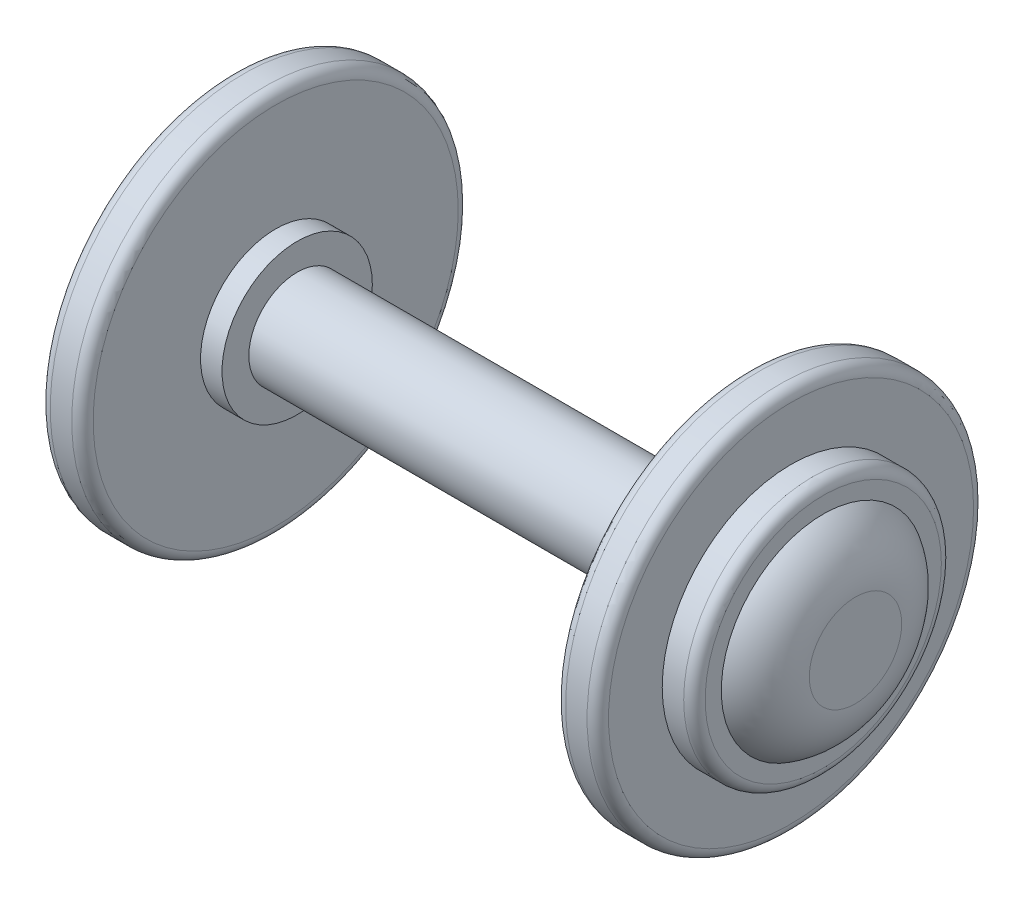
ISO-10303-21;
HEADER;
FILE_DESCRIPTION(('STEP AP214'),'2;1');
FILE_NAME('part.step','',(''),(''),'','','');
FILE_SCHEMA(('AUTOMOTIVE_DESIGN { 1 0 10303 214 1 1 1 1 }'));
ENDSEC;
DATA;
#1=APPLICATION_CONTEXT('core data for automotive mechanical design processes');
#2=APPLICATION_PROTOCOL_DEFINITION('international standard','automotive_design',2000,#1);
#3=PRODUCT_CONTEXT('',#1,'mechanical');
#4=PRODUCT('Part','Part','',(#3));
#5=PRODUCT_RELATED_PRODUCT_CATEGORY('part','',(#4));
#6=PRODUCT_DEFINITION_FORMATION('','',#4);
#7=PRODUCT_DEFINITION_CONTEXT('part definition',#1,'design');
#8=PRODUCT_DEFINITION('design','',#6,#7);
#9=PRODUCT_DEFINITION_SHAPE('','',#8);
#10=(LENGTH_UNIT() NAMED_UNIT(*) SI_UNIT(.MILLI.,.METRE.));
#11=(NAMED_UNIT(*) PLANE_ANGLE_UNIT() SI_UNIT($,.RADIAN.));
#12=(NAMED_UNIT(*) SI_UNIT($,.STERADIAN.) SOLID_ANGLE_UNIT());
#13=UNCERTAINTY_MEASURE_WITH_UNIT(LENGTH_MEASURE(1.E-05),#10,'distance_accuracy_value','');
#14=(GEOMETRIC_REPRESENTATION_CONTEXT(3) GLOBAL_UNCERTAINTY_ASSIGNED_CONTEXT((#13)) GLOBAL_UNIT_ASSIGNED_CONTEXT((#10,
#11,#12)) REPRESENTATION_CONTEXT('',''));
#15=CARTESIAN_POINT('',(0.,0.,0.));
#16=DIRECTION('',(0.,0.,1.));
#17=DIRECTION('',(1.,0.,0.));
#18=AXIS2_PLACEMENT_3D('',#15,#16,#17);
#19=CARTESIAN_POINT('',(11.,6.78141714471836,-5.25000000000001));
#20=DIRECTION('',(1.,0.,0.));
#21=DIRECTION('',(0.,0.,-1.));
#22=AXIS2_PLACEMENT_3D('',#19,#20,#21);
#23=PLANE('',#22);
#24=CARTESIAN_POINT('',(11.,6.78141714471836,-5.25000000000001));
#25=DIRECTION('',(1.,0.,0.));
#26=DIRECTION('',(0.,0.,-1.));
#27=AXIS2_PLACEMENT_3D('',#24,#25,#26);
#28=CIRCLE('',#27,2.25);
#29=CARTESIAN_POINT('',(11.,6.78141714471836,-7.50000000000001));
#30=VERTEX_POINT('',#29);
#31=EDGE_CURVE('E60',#30,#30,#28,.T.);
#32=ORIENTED_EDGE('',*,*,#31,.F.);
#33=EDGE_LOOP('',(#32));
#34=FACE_BOUND('',#33,.T.);
#35=CARTESIAN_POINT('',(11.,6.78141714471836,-5.25000000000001));
#36=DIRECTION('',(1.,0.,0.));
#37=DIRECTION('',(0.,0.,-1.));
#38=AXIS2_PLACEMENT_3D('',#35,#36,#37);
#39=CIRCLE('',#38,3.5);
#40=CARTESIAN_POINT('',(11.,6.78141714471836,-8.75000000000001));
#41=VERTEX_POINT('',#40);
#42=EDGE_CURVE('E11',#41,#41,#39,.T.);
#43=ORIENTED_EDGE('',*,*,#42,.T.);
#44=EDGE_LOOP('',(#43));
#45=FACE_BOUND('',#44,.T.);
#46=ADVANCED_FACE('F47',(#34,#45),#23,.T.);
#47=CARTESIAN_POINT('',(10.,6.78141714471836,-5.25000000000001));
#48=DIRECTION('',(1.,0.,0.));
#49=DIRECTION('',(0.,0.,-1.));
#50=AXIS2_PLACEMENT_3D('',#47,#48,#49);
#51=PLANE('',#50);
#52=CARTESIAN_POINT('',(10.,6.78141714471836,-5.25000000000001));
#53=DIRECTION('',(1.,0.,0.));
#54=DIRECTION('',(0.,0.,-1.));
#55=AXIS2_PLACEMENT_3D('',#52,#53,#54);
#56=CIRCLE('',#55,2.25);
#57=CARTESIAN_POINT('',(10.,6.78141714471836,-7.50000000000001));
#58=VERTEX_POINT('',#57);
#59=EDGE_CURVE('E51',#58,#58,#56,.T.);
#60=ORIENTED_EDGE('',*,*,#59,.T.);
#61=EDGE_LOOP('',(#60));
#62=FACE_BOUND('',#61,.T.);
#63=CARTESIAN_POINT('',(10.,6.78141714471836,-5.25000000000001));
#64=DIRECTION('',(1.,0.,0.));
#65=DIRECTION('',(0.,0.,-1.));
#66=AXIS2_PLACEMENT_3D('',#63,#64,#65);
#67=CIRCLE('',#66,3.5);
#68=CARTESIAN_POINT('',(10.,6.78141714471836,-8.75000000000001));
#69=VERTEX_POINT('',#68);
#70=EDGE_CURVE('E55',#69,#69,#67,.T.);
#71=ORIENTED_EDGE('',*,*,#70,.F.);
#72=EDGE_LOOP('',(#71));
#73=FACE_BOUND('',#72,.T.);
#74=ADVANCED_FACE('F68',(#62,#73),#51,.F.);
#75=CARTESIAN_POINT('',(11.,6.78141714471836,-5.25000000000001));
#76=DIRECTION('',(-1.,0.,0.));
#77=DIRECTION('',(0.,0.,1.));
#78=AXIS2_PLACEMENT_3D('',#75,#76,#77);
#79=CYLINDRICAL_SURFACE('',#78,3.5);
#80=ORIENTED_EDGE('',*,*,#42,.F.);
#81=EDGE_LOOP('',(#80));
#82=FACE_BOUND('',#81,.T.);
#83=ORIENTED_EDGE('',*,*,#70,.T.);
#84=EDGE_LOOP('',(#83));
#85=FACE_BOUND('',#84,.T.);
#86=ADVANCED_FACE('F49',(#82,#85),#79,.T.);
#87=CARTESIAN_POINT('',(-15.,6.78141714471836,-5.25000000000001));
#88=DIRECTION('',(1.,0.,0.));
#89=DIRECTION('',(0.,0.,-1.));
#90=AXIS2_PLACEMENT_3D('',#87,#88,#89);
#91=CYLINDRICAL_SURFACE('',#90,2.25);
#92=ORIENTED_EDGE('',*,*,#31,.T.);
#93=EDGE_LOOP('',(#92));
#94=FACE_BOUND('',#93,.T.);
#95=ORIENTED_EDGE('',*,*,#59,.F.);
#96=EDGE_LOOP('',(#95));
#97=FACE_BOUND('',#96,.T.);
#98=ADVANCED_FACE('F71',(#94,#97),#91,.F.);
#99=CLOSED_SHELL('',(#46,#74,#86,#98));
#100=MANIFOLD_SOLID_BREP('B2',#99);
#101=CARTESIAN_POINT('',(13.,6.78141714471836,-5.25000000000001));
#102=DIRECTION('',(1.,0.,0.));
#103=DIRECTION('',(0.,0.,-1.));
#104=AXIS2_PLACEMENT_3D('',#101,#102,#103);
#105=PLANE('',#104);
#106=CARTESIAN_POINT('',(13.,6.78141714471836,-5.25000000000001));
#107=DIRECTION('',(1.,0.,0.));
#108=DIRECTION('',(0.,0.,-1.));
#109=AXIS2_PLACEMENT_3D('',#106,#107,#108);
#110=CIRCLE('',#109,8.5);
#111=CARTESIAN_POINT('',(13.,6.78141714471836,-13.75));
#112=VERTEX_POINT('',#111);
#113=EDGE_CURVE('E46',#112,#112,#110,.T.);
#114=ORIENTED_EDGE('',*,*,#113,.T.);
#115=EDGE_LOOP('',(#114));
#116=FACE_BOUND('',#115,.T.);
#117=CARTESIAN_POINT('',(13.,6.78141714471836,-5.25000000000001));
#118=DIRECTION('',(1.,0.,0.));
#119=DIRECTION('',(0.,0.,-1.));
#120=AXIS2_PLACEMENT_3D('',#117,#118,#119);
#121=CIRCLE('',#120,6.);
#122=CARTESIAN_POINT('',(13.,6.78141714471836,-11.25));
#123=VERTEX_POINT('',#122);
#124=EDGE_CURVE('E148',#123,#123,#121,.T.);
#125=ORIENTED_EDGE('',*,*,#124,.F.);
#126=EDGE_LOOP('',(#125));
#127=FACE_BOUND('',#126,.T.);
#128=ADVANCED_FACE('F119',(#116,#127),#105,.T.);
#129=CARTESIAN_POINT('',(11.,6.78141714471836,-5.25000000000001));
#130=DIRECTION('',(1.,0.,0.));
#131=DIRECTION('',(0.,0.,-1.));
#132=AXIS2_PLACEMENT_3D('',#129,#130,#131);
#133=PLANE('',#132);
#134=CARTESIAN_POINT('',(11.,6.78141714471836,-5.25000000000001));
#135=DIRECTION('',(1.,0.,0.));
#136=DIRECTION('',(0.,0.,-1.));
#137=AXIS2_PLACEMENT_3D('',#134,#135,#136);
#138=CIRCLE('',#137,8.5);
#139=CARTESIAN_POINT('',(11.,6.78141714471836,-13.75));
#140=VERTEX_POINT('',#139);
#141=EDGE_CURVE('E126',#140,#140,#138,.F.);
#142=ORIENTED_EDGE('',*,*,#141,.T.);
#143=EDGE_LOOP('',(#142));
#144=FACE_BOUND('',#143,.T.);
#145=CARTESIAN_POINT('',(11.,6.78141714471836,-5.25000000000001));
#146=DIRECTION('',(1.,0.,0.));
#147=DIRECTION('',(0.,0.,-1.));
#148=AXIS2_PLACEMENT_3D('',#145,#146,#147);
#149=CIRCLE('',#148,2.5);
#150=CARTESIAN_POINT('',(11.,6.78141714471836,-7.75000000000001));
#151=VERTEX_POINT('',#150);
#152=EDGE_CURVE('E145',#151,#151,#149,.T.);
#153=ORIENTED_EDGE('',*,*,#152,.T.);
#154=EDGE_LOOP('',(#153));
#155=FACE_BOUND('',#154,.T.);
#156=ADVANCED_FACE('F172',(#144,#155),#133,.F.);
#157=CARTESIAN_POINT('',(13.,6.78141714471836,-5.25000000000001));
#158=DIRECTION('',(-1.,0.,0.));
#159=DIRECTION('',(0.,0.,1.));
#160=AXIS2_PLACEMENT_3D('',#157,#158,#159);
#161=CYLINDRICAL_SURFACE('',#160,9.);
#162=CARTESIAN_POINT('',(11.5,6.78141714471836,-5.25000000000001));
#163=DIRECTION('',(1.,0.,0.));
#164=DIRECTION('',(0.,0.,-1.));
#165=AXIS2_PLACEMENT_3D('',#162,#163,#164);
#166=CIRCLE('',#165,9.);
#167=CARTESIAN_POINT('',(11.5,6.78141714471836,-14.25));
#168=VERTEX_POINT('',#167);
#169=EDGE_CURVE('E130',#168,#168,#166,.T.);
#170=ORIENTED_EDGE('',*,*,#169,.T.);
#171=EDGE_LOOP('',(#170));
#172=FACE_BOUND('',#171,.T.);
#173=CARTESIAN_POINT('',(12.5,6.78141714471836,-5.25000000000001));
#174=DIRECTION('',(1.,0.,0.));
#175=DIRECTION('',(0.,0.,-1.));
#176=AXIS2_PLACEMENT_3D('',#173,#174,#175);
#177=CIRCLE('',#176,9.);
#178=CARTESIAN_POINT('',(12.5,6.78141714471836,-14.25));
#179=VERTEX_POINT('',#178);
#180=EDGE_CURVE('E134',#179,#179,#177,.F.);
#181=ORIENTED_EDGE('',*,*,#180,.T.);
#182=EDGE_LOOP('',(#181));
#183=FACE_BOUND('',#182,.T.);
#184=ADVANCED_FACE('F168',(#172,#183),#161,.T.);
#185=CARTESIAN_POINT('',(13.,6.78141714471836,-5.25000000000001));
#186=DIRECTION('',(-1.,0.,0.));
#187=DIRECTION('',(0.,0.,1.));
#188=AXIS2_PLACEMENT_3D('',#185,#186,#187);
#189=CYLINDRICAL_SURFACE('',#188,2.5);
#190=ORIENTED_EDGE('',*,*,#152,.F.);
#191=EDGE_LOOP('',(#190));
#192=FACE_BOUND('',#191,.T.);
#193=CARTESIAN_POINT('',(14.5,6.78141714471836,-5.25000000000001));
#194=DIRECTION('',(1.,0.,0.));
#195=DIRECTION('',(0.,0.,-1.));
#196=AXIS2_PLACEMENT_3D('',#193,#194,#195);
#197=CIRCLE('',#196,2.5);
#198=CARTESIAN_POINT('',(14.5,6.78141714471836,-7.75000000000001));
#199=VERTEX_POINT('',#198);
#200=EDGE_CURVE('E151',#199,#199,#197,.T.);
#201=ORIENTED_EDGE('',*,*,#200,.T.);
#202=EDGE_LOOP('',(#201));
#203=FACE_BOUND('',#202,.T.);
#204=ADVANCED_FACE('F155',(#192,#203),#189,.F.);
#205=CARTESIAN_POINT('',(14.5,6.78141714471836,-5.25000000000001));
#206=DIRECTION('',(1.,0.,0.));
#207=DIRECTION('',(0.,0.,-1.));
#208=AXIS2_PLACEMENT_3D('',#205,#206,#207);
#209=PLANE('',#208);
#210=CARTESIAN_POINT('',(14.5,6.78141714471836,-5.25000000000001));
#211=DIRECTION('',(1.,0.,0.));
#212=DIRECTION('',(0.,0.,-1.));
#213=AXIS2_PLACEMENT_3D('',#210,#211,#212);
#214=CIRCLE('',#213,5.5);
#215=CARTESIAN_POINT('',(14.5,6.78141714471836,-10.75));
#216=VERTEX_POINT('',#215);
#217=EDGE_CURVE('E142',#216,#216,#214,.T.);
#218=ORIENTED_EDGE('',*,*,#217,.T.);
#219=EDGE_LOOP('',(#218));
#220=FACE_BOUND('',#219,.T.);
#221=ORIENTED_EDGE('',*,*,#200,.F.);
#222=EDGE_LOOP('',(#221));
#223=FACE_BOUND('',#222,.T.);
#224=ADVANCED_FACE('F157',(#220,#223),#209,.T.);
#225=CARTESIAN_POINT('',(14.5,6.78141714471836,-5.25000000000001));
#226=DIRECTION('',(-1.,0.,0.));
#227=DIRECTION('',(0.,0.,1.));
#228=AXIS2_PLACEMENT_3D('',#225,#226,#227);
#229=CYLINDRICAL_SURFACE('',#228,6.);
#230=CARTESIAN_POINT('',(14.,6.78141714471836,-5.25000000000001));
#231=DIRECTION('',(1.,0.,0.));
#232=DIRECTION('',(0.,0.,-1.));
#233=AXIS2_PLACEMENT_3D('',#230,#231,#232);
#234=CIRCLE('',#233,6.);
#235=CARTESIAN_POINT('',(14.,6.78141714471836,-11.25));
#236=VERTEX_POINT('',#235);
#237=EDGE_CURVE('E139',#236,#236,#234,.F.);
#238=ORIENTED_EDGE('',*,*,#237,.T.);
#239=EDGE_LOOP('',(#238));
#240=FACE_BOUND('',#239,.T.);
#241=ORIENTED_EDGE('',*,*,#124,.T.);
#242=EDGE_LOOP('',(#241));
#243=FACE_BOUND('',#242,.T.);
#244=ADVANCED_FACE('F159',(#240,#243),#229,.T.);
#245=CARTESIAN_POINT('',(14.,6.78141714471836,-5.25000000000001));
#246=DIRECTION('',(1.,0.,0.));
#247=DIRECTION('',(0.,0.,-1.));
#248=AXIS2_PLACEMENT_3D('',#245,#246,#247);
#249=TOROIDAL_SURFACE('',#248,5.5,0.5);
#250=ORIENTED_EDGE('',*,*,#237,.F.);
#251=EDGE_LOOP('',(#250));
#252=FACE_BOUND('',#251,.T.);
#253=ORIENTED_EDGE('',*,*,#217,.F.);
#254=EDGE_LOOP('',(#253));
#255=FACE_BOUND('',#254,.T.);
#256=ADVANCED_FACE('F164',(#252,#255),#249,.T.);
#257=CARTESIAN_POINT('',(11.5,6.78141714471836,-5.25000000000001));
#258=DIRECTION('',(1.,0.,0.));
#259=DIRECTION('',(0.,0.,-1.));
#260=AXIS2_PLACEMENT_3D('',#257,#258,#259);
#261=TOROIDAL_SURFACE('',#260,8.5,0.5);
#262=ORIENTED_EDGE('',*,*,#141,.F.);
#263=EDGE_LOOP('',(#262));
#264=FACE_BOUND('',#263,.T.);
#265=ORIENTED_EDGE('',*,*,#169,.F.);
#266=EDGE_LOOP('',(#265));
#267=FACE_BOUND('',#266,.T.);
#268=ADVANCED_FACE('F184',(#264,#267),#261,.T.);
#269=CARTESIAN_POINT('',(12.5,6.78141714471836,-5.25000000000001));
#270=DIRECTION('',(1.,0.,0.));
#271=DIRECTION('',(0.,0.,-1.));
#272=AXIS2_PLACEMENT_3D('',#269,#270,#271);
#273=TOROIDAL_SURFACE('',#272,8.5,0.5);
#274=ORIENTED_EDGE('',*,*,#180,.F.);
#275=EDGE_LOOP('',(#274));
#276=FACE_BOUND('',#275,.T.);
#277=ORIENTED_EDGE('',*,*,#113,.F.);
#278=EDGE_LOOP('',(#277));
#279=FACE_BOUND('',#278,.T.);
#280=ADVANCED_FACE('F121',(#276,#279),#273,.T.);
#281=CLOSED_SHELL('',(#128,#156,#184,#204,#224,#244,#256,#268,#280));
#282=MANIFOLD_SOLID_BREP('B6',#281);
#283=CARTESIAN_POINT('',(-11.,6.78141714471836,-5.25000000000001));
#284=DIRECTION('',(-1.,0.,0.));
#285=DIRECTION('',(0.,0.,-1.));
#286=AXIS2_PLACEMENT_3D('',#283,#284,#285);
#287=PLANE('',#286);
#288=CARTESIAN_POINT('',(-11.,6.78141714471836,-5.25000000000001));
#289=DIRECTION('',(-1.,0.,0.));
#290=DIRECTION('',(0.,0.,1.));
#291=AXIS2_PLACEMENT_3D('',#288,#289,#290);
#292=CIRCLE('',#291,2.25);
#293=CARTESIAN_POINT('',(-11.,6.78141714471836,-3.00000000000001));
#294=VERTEX_POINT('',#293);
#295=EDGE_CURVE('E280',#294,#294,#292,.T.);
#296=ORIENTED_EDGE('',*,*,#295,.F.);
#297=EDGE_LOOP('',(#296));
#298=FACE_BOUND('',#297,.T.);
#299=CARTESIAN_POINT('',(-11.,6.78141714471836,-5.25000000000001));
#300=DIRECTION('',(1.,0.,0.));
#301=DIRECTION('',(0.,0.,-1.));
#302=AXIS2_PLACEMENT_3D('',#299,#300,#301);
#303=CIRCLE('',#302,3.5);
#304=CARTESIAN_POINT('',(-11.,6.78141714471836,-8.75000000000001));
#305=VERTEX_POINT('',#304);
#306=EDGE_CURVE('E118',#305,#305,#303,.T.);
#307=ORIENTED_EDGE('',*,*,#306,.F.);
#308=EDGE_LOOP('',(#307));
#309=FACE_BOUND('',#308,.T.);
#310=ADVANCED_FACE('F267',(#298,#309),#287,.T.);
#311=CARTESIAN_POINT('',(-10.,6.78141714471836,-5.25000000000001));
#312=DIRECTION('',(-1.,0.,0.));
#313=DIRECTION('',(0.,0.,-1.));
#314=AXIS2_PLACEMENT_3D('',#311,#312,#313);
#315=PLANE('',#314);
#316=CARTESIAN_POINT('',(-10.,6.78141714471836,-5.25000000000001));
#317=DIRECTION('',(-1.,0.,0.));
#318=DIRECTION('',(0.,0.,1.));
#319=AXIS2_PLACEMENT_3D('',#316,#317,#318);
#320=CIRCLE('',#319,2.25);
#321=CARTESIAN_POINT('',(-10.,6.78141714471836,-3.00000000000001));
#322=VERTEX_POINT('',#321);
#323=EDGE_CURVE('E271',#322,#322,#320,.T.);
#324=ORIENTED_EDGE('',*,*,#323,.T.);
#325=EDGE_LOOP('',(#324));
#326=FACE_BOUND('',#325,.T.);
#327=CARTESIAN_POINT('',(-10.,6.78141714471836,-5.25000000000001));
#328=DIRECTION('',(1.,0.,0.));
#329=DIRECTION('',(0.,0.,-1.));
#330=AXIS2_PLACEMENT_3D('',#327,#328,#329);
#331=CIRCLE('',#330,3.5);
#332=CARTESIAN_POINT('',(-10.,6.78141714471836,-8.75000000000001));
#333=VERTEX_POINT('',#332);
#334=EDGE_CURVE('E275',#333,#333,#331,.T.);
#335=ORIENTED_EDGE('',*,*,#334,.T.);
#336=EDGE_LOOP('',(#335));
#337=FACE_BOUND('',#336,.T.);
#338=ADVANCED_FACE('F288',(#326,#337),#315,.F.);
#339=CARTESIAN_POINT('',(-11.,6.78141714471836,-5.25000000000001));
#340=DIRECTION('',(1.,0.,0.));
#341=DIRECTION('',(0.,0.,1.));
#342=AXIS2_PLACEMENT_3D('',#339,#340,#341);
#343=CYLINDRICAL_SURFACE('',#342,3.5);
#344=ORIENTED_EDGE('',*,*,#306,.T.);
#345=EDGE_LOOP('',(#344));
#346=FACE_BOUND('',#345,.T.);
#347=ORIENTED_EDGE('',*,*,#334,.F.);
#348=EDGE_LOOP('',(#347));
#349=FACE_BOUND('',#348,.T.);
#350=ADVANCED_FACE('F269',(#346,#349),#343,.T.);
#351=CARTESIAN_POINT('',(-15.,6.78141714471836,-5.25000000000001));
#352=DIRECTION('',(1.,0.,0.));
#353=DIRECTION('',(0.,0.,-1.));
#354=AXIS2_PLACEMENT_3D('',#351,#352,#353);
#355=CYLINDRICAL_SURFACE('',#354,2.25);
#356=ORIENTED_EDGE('',*,*,#295,.T.);
#357=EDGE_LOOP('',(#356));
#358=FACE_BOUND('',#357,.T.);
#359=ORIENTED_EDGE('',*,*,#323,.F.);
#360=EDGE_LOOP('',(#359));
#361=FACE_BOUND('',#360,.T.);
#362=ADVANCED_FACE('F291',(#358,#361),#355,.F.);
#363=CLOSED_SHELL('',(#310,#338,#350,#362));
#364=MANIFOLD_SOLID_BREP('B41',#363);
#365=CARTESIAN_POINT('',(-13.,6.78141714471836,-5.25000000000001));
#366=DIRECTION('',(-1.,0.,0.));
#367=DIRECTION('',(0.,0.,-1.));
#368=AXIS2_PLACEMENT_3D('',#365,#366,#367);
#369=PLANE('',#368);
#370=CARTESIAN_POINT('',(-13.,6.78141714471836,-5.25000000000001));
#371=DIRECTION('',(1.,0.,0.));
#372=DIRECTION('',(0.,0.,-1.));
#373=AXIS2_PLACEMENT_3D('',#370,#371,#372);
#374=CIRCLE('',#373,8.5);
#375=CARTESIAN_POINT('',(-13.,6.78141714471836,-13.75));
#376=VERTEX_POINT('',#375);
#377=EDGE_CURVE('E266',#376,#376,#374,.T.);
#378=ORIENTED_EDGE('',*,*,#377,.F.);
#379=EDGE_LOOP('',(#378));
#380=FACE_BOUND('',#379,.T.);
#381=CARTESIAN_POINT('',(-13.,6.78141714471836,-5.25000000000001));
#382=DIRECTION('',(1.,0.,0.));
#383=DIRECTION('',(0.,0.,-1.));
#384=AXIS2_PLACEMENT_3D('',#381,#382,#383);
#385=CIRCLE('',#384,6.);
#386=CARTESIAN_POINT('',(-13.,6.78141714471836,-11.25));
#387=VERTEX_POINT('',#386);
#388=EDGE_CURVE('E367',#387,#387,#385,.T.);
#389=ORIENTED_EDGE('',*,*,#388,.T.);
#390=EDGE_LOOP('',(#389));
#391=FACE_BOUND('',#390,.T.);
#392=ADVANCED_FACE('F338',(#380,#391),#369,.T.);
#393=CARTESIAN_POINT('',(-11.,6.78141714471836,-5.25000000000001));
#394=DIRECTION('',(-1.,0.,0.));
#395=DIRECTION('',(0.,0.,-1.));
#396=AXIS2_PLACEMENT_3D('',#393,#394,#395);
#397=PLANE('',#396);
#398=CARTESIAN_POINT('',(-11.,6.78141714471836,-5.25000000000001));
#399=DIRECTION('',(1.,0.,0.));
#400=DIRECTION('',(0.,0.,-1.));
#401=AXIS2_PLACEMENT_3D('',#398,#399,#400);
#402=CIRCLE('',#401,8.5);
#403=CARTESIAN_POINT('',(-11.,6.78141714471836,-13.75));
#404=VERTEX_POINT('',#403);
#405=EDGE_CURVE('E345',#404,#404,#402,.F.);
#406=ORIENTED_EDGE('',*,*,#405,.F.);
#407=EDGE_LOOP('',(#406));
#408=FACE_BOUND('',#407,.T.);
#409=CARTESIAN_POINT('',(-11.,6.78141714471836,-5.25000000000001));
#410=DIRECTION('',(1.,0.,0.));
#411=DIRECTION('',(0.,0.,-1.));
#412=AXIS2_PLACEMENT_3D('',#409,#410,#411);
#413=CIRCLE('',#412,2.5);
#414=CARTESIAN_POINT('',(-11.,6.78141714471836,-7.75000000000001));
#415=VERTEX_POINT('',#414);
#416=EDGE_CURVE('E364',#415,#415,#413,.T.);
#417=ORIENTED_EDGE('',*,*,#416,.F.);
#418=EDGE_LOOP('',(#417));
#419=FACE_BOUND('',#418,.T.);
#420=ADVANCED_FACE('F388',(#408,#419),#397,.F.);
#421=CARTESIAN_POINT('',(-13.,6.78141714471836,-5.25000000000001));
#422=DIRECTION('',(1.,0.,0.));
#423=DIRECTION('',(0.,0.,1.));
#424=AXIS2_PLACEMENT_3D('',#421,#422,#423);
#425=CYLINDRICAL_SURFACE('',#424,9.);
#426=CARTESIAN_POINT('',(-11.5,6.78141714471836,-5.25000000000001));
#427=DIRECTION('',(1.,0.,0.));
#428=DIRECTION('',(0.,0.,-1.));
#429=AXIS2_PLACEMENT_3D('',#426,#427,#428);
#430=CIRCLE('',#429,9.);
#431=CARTESIAN_POINT('',(-11.5,6.78141714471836,-14.25));
#432=VERTEX_POINT('',#431);
#433=EDGE_CURVE('E349',#432,#432,#430,.T.);
#434=ORIENTED_EDGE('',*,*,#433,.F.);
#435=EDGE_LOOP('',(#434));
#436=FACE_BOUND('',#435,.T.);
#437=CARTESIAN_POINT('',(-12.5,6.78141714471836,-5.25000000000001));
#438=DIRECTION('',(1.,0.,0.));
#439=DIRECTION('',(0.,0.,-1.));
#440=AXIS2_PLACEMENT_3D('',#437,#438,#439);
#441=CIRCLE('',#440,9.);
#442=CARTESIAN_POINT('',(-12.5,6.78141714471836,-14.25));
#443=VERTEX_POINT('',#442);
#444=EDGE_CURVE('E353',#443,#443,#441,.F.);
#445=ORIENTED_EDGE('',*,*,#444,.F.);
#446=EDGE_LOOP('',(#445));
#447=FACE_BOUND('',#446,.T.);
#448=ADVANCED_FACE('F378',(#436,#447),#425,.T.);
#449=CARTESIAN_POINT('',(-13.,6.78141714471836,-5.25000000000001));
#450=DIRECTION('',(1.,0.,0.));
#451=DIRECTION('',(0.,0.,1.));
#452=AXIS2_PLACEMENT_3D('',#449,#450,#451);
#453=CYLINDRICAL_SURFACE('',#452,2.5);
#454=ORIENTED_EDGE('',*,*,#416,.T.);
#455=EDGE_LOOP('',(#454));
#456=FACE_BOUND('',#455,.T.);
#457=CARTESIAN_POINT('',(-14.5,6.78141714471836,-5.25000000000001));
#458=DIRECTION('',(1.,0.,0.));
#459=DIRECTION('',(0.,0.,-1.));
#460=AXIS2_PLACEMENT_3D('',#457,#458,#459);
#461=CIRCLE('',#460,2.5);
#462=CARTESIAN_POINT('',(-14.5,6.78141714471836,-7.75000000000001));
#463=VERTEX_POINT('',#462);
#464=EDGE_CURVE('E370',#463,#463,#461,.T.);
#465=ORIENTED_EDGE('',*,*,#464,.F.);
#466=EDGE_LOOP('',(#465));
#467=FACE_BOUND('',#466,.T.);
#468=ADVANCED_FACE('F376',(#456,#467),#453,.F.);
#469=CARTESIAN_POINT('',(-14.5,6.78141714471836,-5.25000000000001));
#470=DIRECTION('',(-1.,0.,0.));
#471=DIRECTION('',(0.,0.,-1.));
#472=AXIS2_PLACEMENT_3D('',#469,#470,#471);
#473=PLANE('',#472);
#474=CARTESIAN_POINT('',(-14.5,6.78141714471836,-5.25000000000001));
#475=DIRECTION('',(1.,0.,0.));
#476=DIRECTION('',(0.,0.,-1.));
#477=AXIS2_PLACEMENT_3D('',#474,#475,#476);
#478=CIRCLE('',#477,5.5);
#479=CARTESIAN_POINT('',(-14.5,6.78141714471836,-10.75));
#480=VERTEX_POINT('',#479);
#481=EDGE_CURVE('E361',#480,#480,#478,.T.);
#482=ORIENTED_EDGE('',*,*,#481,.F.);
#483=EDGE_LOOP('',(#482));
#484=FACE_BOUND('',#483,.T.);
#485=ORIENTED_EDGE('',*,*,#464,.T.);
#486=EDGE_LOOP('',(#485));
#487=FACE_BOUND('',#486,.T.);
#488=ADVANCED_FACE('F374',(#484,#487),#473,.T.);
#489=CARTESIAN_POINT('',(-14.5,6.78141714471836,-5.25000000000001));
#490=DIRECTION('',(1.,0.,0.));
#491=DIRECTION('',(0.,0.,1.));
#492=AXIS2_PLACEMENT_3D('',#489,#490,#491);
#493=CYLINDRICAL_SURFACE('',#492,6.);
#494=CARTESIAN_POINT('',(-14.,6.78141714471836,-5.25000000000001));
#495=DIRECTION('',(1.,0.,0.));
#496=DIRECTION('',(0.,0.,-1.));
#497=AXIS2_PLACEMENT_3D('',#494,#495,#496);
#498=CIRCLE('',#497,6.);
#499=CARTESIAN_POINT('',(-14.,6.78141714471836,-11.25));
#500=VERTEX_POINT('',#499);
#501=EDGE_CURVE('E358',#500,#500,#498,.F.);
#502=ORIENTED_EDGE('',*,*,#501,.F.);
#503=EDGE_LOOP('',(#502));
#504=FACE_BOUND('',#503,.T.);
#505=ORIENTED_EDGE('',*,*,#388,.F.);
#506=EDGE_LOOP('',(#505));
#507=FACE_BOUND('',#506,.T.);
#508=ADVANCED_FACE('F385',(#504,#507),#493,.T.);
#509=CARTESIAN_POINT('',(-14.,6.78141714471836,-5.25000000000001));
#510=DIRECTION('',(-1.,0.,0.));
#511=DIRECTION('',(0.,0.,-1.));
#512=AXIS2_PLACEMENT_3D('',#509,#510,#511);
#513=TOROIDAL_SURFACE('',#512,5.5,0.5);
#514=ORIENTED_EDGE('',*,*,#501,.T.);
#515=EDGE_LOOP('',(#514));
#516=FACE_BOUND('',#515,.T.);
#517=ORIENTED_EDGE('',*,*,#481,.T.);
#518=EDGE_LOOP('',(#517));
#519=FACE_BOUND('',#518,.T.);
#520=ADVANCED_FACE('F402',(#516,#519),#513,.T.);
#521=CARTESIAN_POINT('',(-11.5,6.78141714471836,-5.25000000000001));
#522=DIRECTION('',(-1.,0.,0.));
#523=DIRECTION('',(0.,0.,-1.));
#524=AXIS2_PLACEMENT_3D('',#521,#522,#523);
#525=TOROIDAL_SURFACE('',#524,8.5,0.5);
#526=ORIENTED_EDGE('',*,*,#405,.T.);
#527=EDGE_LOOP('',(#526));
#528=FACE_BOUND('',#527,.T.);
#529=ORIENTED_EDGE('',*,*,#433,.T.);
#530=EDGE_LOOP('',(#529));
#531=FACE_BOUND('',#530,.T.);
#532=ADVANCED_FACE('F404',(#528,#531),#525,.T.);
#533=CARTESIAN_POINT('',(-12.5,6.78141714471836,-5.25000000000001));
#534=DIRECTION('',(-1.,0.,0.));
#535=DIRECTION('',(0.,0.,-1.));
#536=AXIS2_PLACEMENT_3D('',#533,#534,#535);
#537=TOROIDAL_SURFACE('',#536,8.5,0.5);
#538=ORIENTED_EDGE('',*,*,#444,.T.);
#539=EDGE_LOOP('',(#538));
#540=FACE_BOUND('',#539,.T.);
#541=ORIENTED_EDGE('',*,*,#377,.T.);
#542=EDGE_LOOP('',(#541));
#543=FACE_BOUND('',#542,.T.);
#544=ADVANCED_FACE('F340',(#540,#543),#537,.T.);
#545=CLOSED_SHELL('',(#392,#420,#448,#468,#488,#508,#520,#532,#544));
#546=MANIFOLD_SOLID_BREP('B113',#545);
#547=CARTESIAN_POINT('',(14.5,6.78141714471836,-5.25000000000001));
#548=DIRECTION('',(1.,0.,0.));
#549=DIRECTION('',(0.,0.,-1.));
#550=AXIS2_PLACEMENT_3D('',#547,#548,#549);
#551=PLANE('',#550);
#552=CARTESIAN_POINT('',(14.5,6.78141714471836,-5.25000000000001));
#553=DIRECTION('',(1.,0.,0.));
#554=DIRECTION('',(0.,0.,-1.));
#555=AXIS2_PLACEMENT_3D('',#552,#553,#554);
#556=CIRCLE('',#555,2.25);
#557=CARTESIAN_POINT('',(14.5,6.78141714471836,-7.50000000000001));
#558=VERTEX_POINT('',#557);
#559=EDGE_CURVE('E503',#558,#558,#556,.T.);
#560=ORIENTED_EDGE('',*,*,#559,.T.);
#561=EDGE_LOOP('',(#560));
#562=FACE_BOUND('',#561,.T.);
#563=CARTESIAN_POINT('',(14.5,6.78141714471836,-5.25000000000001));
#564=DIRECTION('',(1.,0.,0.));
#565=DIRECTION('',(0.,0.,-1.));
#566=AXIS2_PLACEMENT_3D('',#563,#564,#565);
#567=CIRCLE('',#566,4.75);
#568=CARTESIAN_POINT('',(14.5,6.78141714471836,-10.));
#569=VERTEX_POINT('',#568);
#570=EDGE_CURVE('E488',#569,#569,#567,.T.);
#571=ORIENTED_EDGE('',*,*,#570,.F.);
#572=EDGE_LOOP('',(#571));
#573=FACE_BOUND('',#572,.T.);
#574=ADVANCED_FACE('F479',(#562,#573),#551,.F.);
#575=CARTESIAN_POINT('',(16.,6.78141714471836,-5.25000000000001));
#576=DIRECTION('',(1.,0.,0.));
#577=DIRECTION('',(0.,0.,-1.));
#578=AXIS2_PLACEMENT_3D('',#575,#576,#577);
#579=PLANE('',#578);
#580=CARTESIAN_POINT('',(16.,6.78141714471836,-5.25000000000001));
#581=DIRECTION('',(1.,0.,0.));
#582=DIRECTION('',(0.,0.,-1.));
#583=AXIS2_PLACEMENT_3D('',#580,#581,#582);
#584=CIRCLE('',#583,2.15192378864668);
#585=CARTESIAN_POINT('',(16.,6.78141714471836,-7.4019237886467));
#586=VERTEX_POINT('',#585);
#587=EDGE_CURVE('E337',#586,#586,#584,.T.);
#588=ORIENTED_EDGE('',*,*,#587,.T.);
#589=EDGE_LOOP('',(#588));
#590=FACE_BOUND('',#589,.T.);
#591=ADVANCED_FACE('F527',(#590),#579,.T.);
#592=CARTESIAN_POINT('',(13.,6.78141714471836,-5.25000000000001));
#593=DIRECTION('',(-1.,0.,0.));
#594=DIRECTION('',(0.,0.,1.));
#595=AXIS2_PLACEMENT_3D('',#592,#593,#594);
#596=DEGENERATE_TOROIDAL_SURFACE('',#595,2.15192378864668,3.,.T.);
#597=ORIENTED_EDGE('',*,*,#570,.T.);
#598=EDGE_LOOP('',(#597));
#599=FACE_BOUND('',#598,.T.);
#600=ORIENTED_EDGE('',*,*,#587,.F.);
#601=EDGE_LOOP('',(#600));
#602=FACE_BOUND('',#601,.T.);
#603=ADVANCED_FACE('F481',(#599,#602),#596,.T.);
#604=CARTESIAN_POINT('',(-15.,6.78141714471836,-5.25000000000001));
#605=DIRECTION('',(1.,0.,0.));
#606=DIRECTION('',(0.,0.,-1.));
#607=AXIS2_PLACEMENT_3D('',#604,#605,#606);
#608=CYLINDRICAL_SURFACE('',#607,2.25);
#609=CARTESIAN_POINT('',(-14.5,6.78141714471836,-5.25000000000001));
#610=DIRECTION('',(-1.,0.,0.));
#611=DIRECTION('',(0.,0.,1.));
#612=AXIS2_PLACEMENT_3D('',#609,#610,#611);
#613=CIRCLE('',#612,2.25);
#614=CARTESIAN_POINT('',(-14.5,6.78141714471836,-3.00000000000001));
#615=VERTEX_POINT('',#614);
#616=EDGE_CURVE('E483',#615,#615,#613,.T.);
#617=ORIENTED_EDGE('',*,*,#616,.F.);
#618=EDGE_LOOP('',(#617));
#619=FACE_BOUND('',#618,.T.);
#620=ORIENTED_EDGE('',*,*,#559,.F.);
#621=EDGE_LOOP('',(#620));
#622=FACE_BOUND('',#621,.T.);
#623=ADVANCED_FACE('F515',(#619,#622),#608,.T.);
#624=CARTESIAN_POINT('',(-16.,6.78141714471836,-5.25000000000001));
#625=DIRECTION('',(1.,0.,0.));
#626=DIRECTION('',(0.,0.,-1.));
#627=AXIS2_PLACEMENT_3D('',#624,#625,#626);
#628=PLANE('',#627);
#629=CARTESIAN_POINT('',(-16.,6.78141714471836,-5.25000000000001));
#630=DIRECTION('',(1.,0.,0.));
#631=DIRECTION('',(0.,0.,-1.));
#632=AXIS2_PLACEMENT_3D('',#629,#630,#631);
#633=CIRCLE('',#632,2.15192378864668);
#634=CARTESIAN_POINT('',(-16.,6.78141714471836,-7.4019237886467));
#635=VERTEX_POINT('',#634);
#636=EDGE_CURVE('E493',#635,#635,#633,.T.);
#637=ORIENTED_EDGE('',*,*,#636,.F.);
#638=EDGE_LOOP('',(#637));
#639=FACE_BOUND('',#638,.T.);
#640=ADVANCED_FACE('F518',(#639),#628,.F.);
#641=CARTESIAN_POINT('',(-13.,6.78141714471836,-5.25000000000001));
#642=DIRECTION('',(1.,0.,0.));
#643=DIRECTION('',(0.,0.,1.));
#644=AXIS2_PLACEMENT_3D('',#641,#642,#643);
#645=DEGENERATE_TOROIDAL_SURFACE('',#644,2.15192378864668,3.,.T.);
#646=CARTESIAN_POINT('',(-14.5,6.78141714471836,-5.25000000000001));
#647=DIRECTION('',(1.,0.,0.));
#648=DIRECTION('',(0.,0.,-1.));
#649=AXIS2_PLACEMENT_3D('',#646,#647,#648);
#650=CIRCLE('',#649,4.75);
#651=CARTESIAN_POINT('',(-14.5,6.78141714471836,-10.));
#652=VERTEX_POINT('',#651);
#653=EDGE_CURVE('E499',#652,#652,#650,.T.);
#654=ORIENTED_EDGE('',*,*,#653,.F.);
#655=EDGE_LOOP('',(#654));
#656=FACE_BOUND('',#655,.T.);
#657=ORIENTED_EDGE('',*,*,#636,.T.);
#658=EDGE_LOOP('',(#657));
#659=FACE_BOUND('',#658,.T.);
#660=ADVANCED_FACE('F523',(#656,#659),#645,.T.);
#661=CARTESIAN_POINT('',(-14.5,6.78141714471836,-5.25000000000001));
#662=DIRECTION('',(-1.,0.,0.));
#663=DIRECTION('',(0.,0.,-1.));
#664=AXIS2_PLACEMENT_3D('',#661,#662,#663);
#665=PLANE('',#664);
#666=ORIENTED_EDGE('',*,*,#616,.T.);
#667=EDGE_LOOP('',(#666));
#668=FACE_BOUND('',#667,.T.);
#669=ORIENTED_EDGE('',*,*,#653,.T.);
#670=EDGE_LOOP('',(#669));
#671=FACE_BOUND('',#670,.T.);
#672=ADVANCED_FACE('F512',(#668,#671),#665,.F.);
#673=CLOSED_SHELL('',(#574,#591,#603,#623,#640,#660,#672));
#674=MANIFOLD_SOLID_BREP('B261',#673);
#675=ADVANCED_BREP_SHAPE_REPRESENTATION('',(#18,#100,#282,#364,#546,#674),#14);
#676=SHAPE_DEFINITION_REPRESENTATION(#9,#675);
ENDSEC;
END-ISO-10303-21;
